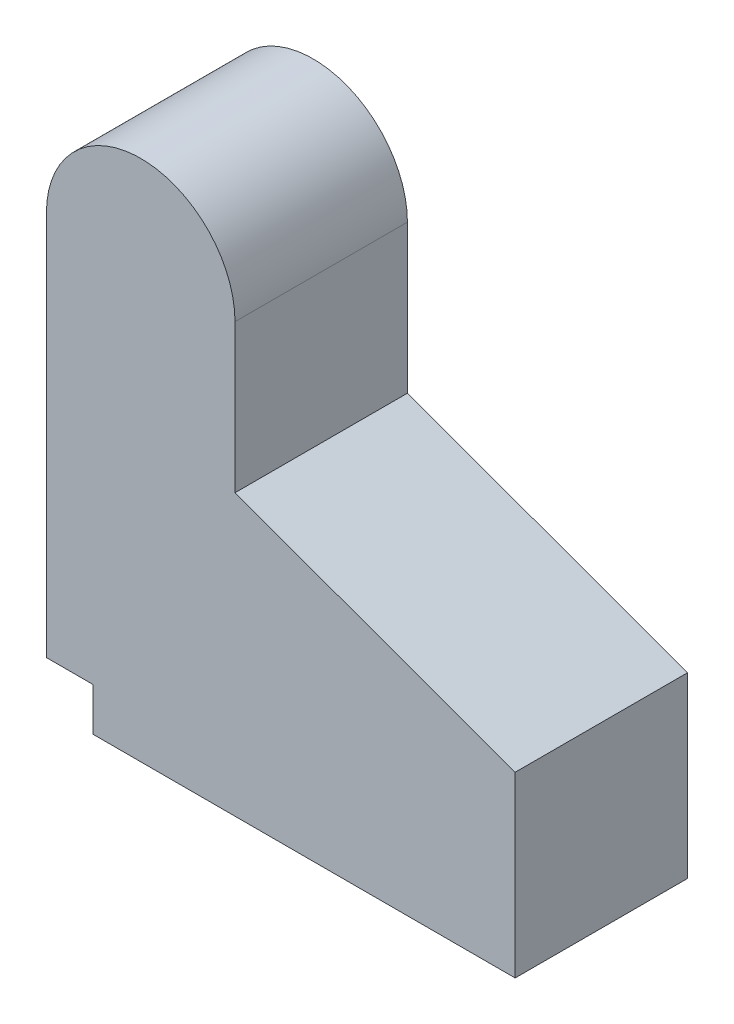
from build123d import *

# Parameters (mm, degrees)
EXTRUSION1_DEPTH = 16


with BuildPart() as part:
    # Esquisse1 → Extrusion1 (new body)
    with BuildSketch(Plane.XY):
        with BuildLine():
            Line((4.3, 0), (43.5, 0))
            Line((43.5, 0), (43.5, 16.536773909))
            Line((43.5, 16.536773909), (17.5, 26))
            Line((17.5, 26), (17.5, 39.75))
            ThreePointArc((17.5, 39.75), (8.75, 48.5), (0, 39.75))
            Line((0, 39.75), (0, 4))
            Line((0, 4), (4.3, 4))
            Line((4.3, 4), (4.3, 0))
        make_face()
    extrude(amount=EXTRUSION1_DEPTH)


solid = part.part
